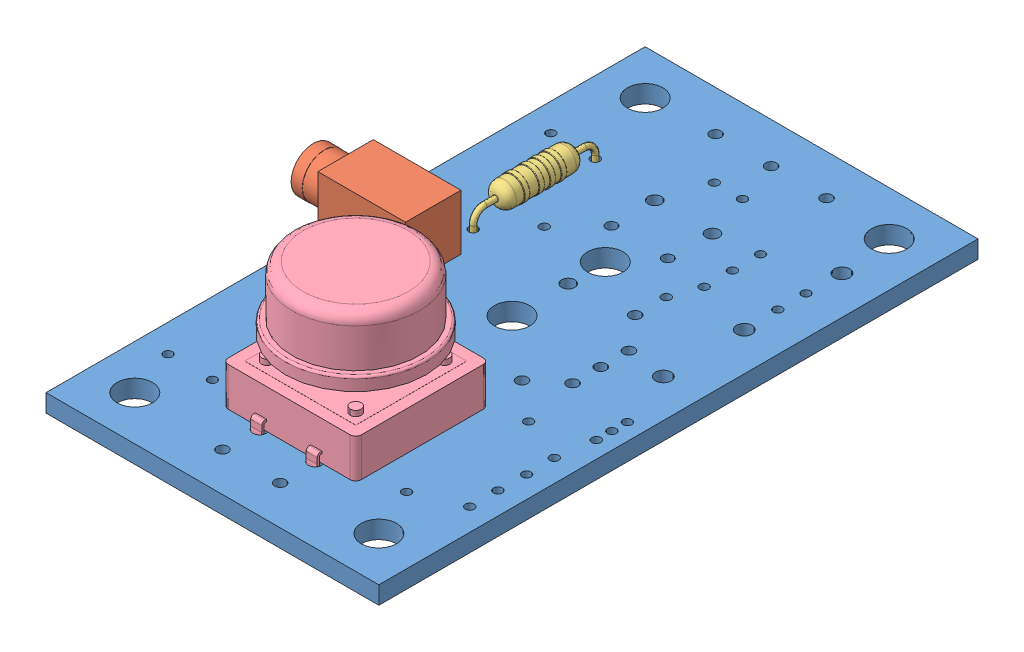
SolidWorks assembly Module Bouton poussoir.SLDASM, configuration Défaut (file format 7000). Lengths in mm.
Overall size (32.91 14.32 54).
5 component instances, 4 part files, 3 mates.
Components (placement in the parent):
- CI-AP-MLBP avec jack-1: CI-AP-MLBP avec jack.SLDASM [Défaut] at (1.1247 -1.2172 0) size (32.91 8.01 54)
  - CI BP et DEL-1: CI BP et DEL.SLDPRT [Défaut] at (-14.8869 -1.2382 0) size (30 1.6 54)
  - Embase jack 2.5-1: Embase jack 2.5.SLDPRT [Défaut] at (-14.8868 0.3618 -27.0002) size (10.81 8.01 5)
- Résistance 10 K pas 11-1: Résistance 10 K pas 11.SLDPRT [Défaut] at (-7.2623 0.5446 -37.4989) x (0 0 -1) z (1 0 0) size (11.5 4.15 2.3)
- Bouton poussoir 12x12-1: Bouton poussoir 12x12.SLDPRT [Défaut] at (1.2433 -0.8554 -12.9124) x (0 0 -1) z (1 0 0) size (14.01 14.31 12.84)
Mates (geometry in assembly coordinates):
- Coïncidente1: coincident aligned: axis of CI-AP-MLBP avec jack-1/CI BP et DEL-1 through (-7.2623 -0.8554 -31.9989) axis (0 -1 0); axis of Résistance 10 K pas 11-1 through (-7.2623 -0.4554 -31.9989) axis (0 -1 0)
- Coïncidente2: coincident aligned: axis of CI-AP-MLBP avec jack-1/CI BP et DEL-1 through (-7.2623 -0.8554 -42.9997) axis (0 -1 0); axis of Résistance 10 K pas 11-1 through (-7.2623 -0.4554 -42.9989) axis (0 -1 0)
- Coïncidente3: coincident aligned: plane of CI-AP-MLBP avec jack-1/CI BP et DEL-1 through (-13.7622 -2.4554 -54) normal (0 -1 0); plane of Résistance 10 K pas 11-1 through (-7.2623 -2.4554 -31.9989) normal (0 -1 0)
